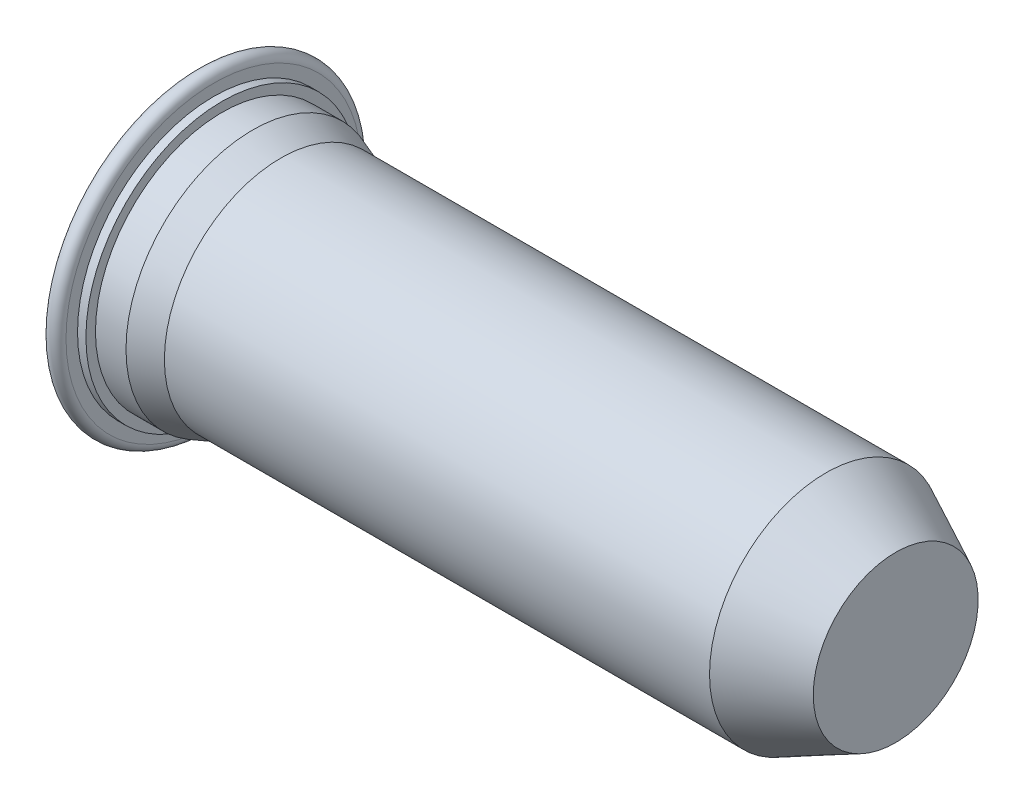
ISO-10303-21;
HEADER;
FILE_DESCRIPTION(('STEP AP214'),'2;1');
FILE_NAME('part.step','',(''),(''),'','','');
FILE_SCHEMA(('AUTOMOTIVE_DESIGN { 1 0 10303 214 1 1 1 1 }'));
ENDSEC;
DATA;
#1=APPLICATION_CONTEXT('core data for automotive mechanical design processes');
#2=APPLICATION_PROTOCOL_DEFINITION('international standard','automotive_design',2000,#1);
#3=PRODUCT_CONTEXT('',#1,'mechanical');
#4=PRODUCT('Part','Part','',(#3));
#5=PRODUCT_RELATED_PRODUCT_CATEGORY('part','',(#4));
#6=PRODUCT_DEFINITION_FORMATION('','',#4);
#7=PRODUCT_DEFINITION_CONTEXT('part definition',#1,'design');
#8=PRODUCT_DEFINITION('design','',#6,#7);
#9=PRODUCT_DEFINITION_SHAPE('','',#8);
#10=(LENGTH_UNIT() NAMED_UNIT(*) SI_UNIT(.MILLI.,.METRE.));
#11=(NAMED_UNIT(*) PLANE_ANGLE_UNIT() SI_UNIT($,.RADIAN.));
#12=(NAMED_UNIT(*) SI_UNIT($,.STERADIAN.) SOLID_ANGLE_UNIT());
#13=UNCERTAINTY_MEASURE_WITH_UNIT(LENGTH_MEASURE(1.E-05),#10,'distance_accuracy_value','');
#14=(GEOMETRIC_REPRESENTATION_CONTEXT(3) GLOBAL_UNCERTAINTY_ASSIGNED_CONTEXT((#13)) GLOBAL_UNIT_ASSIGNED_CONTEXT((#10,
#11,#12)) REPRESENTATION_CONTEXT('',''));
#15=CARTESIAN_POINT('',(0.,0.,0.));
#16=DIRECTION('',(0.,0.,1.));
#17=DIRECTION('',(1.,0.,0.));
#18=AXIS2_PLACEMENT_3D('',#15,#16,#17);
#19=CARTESIAN_POINT('',(0.,0.,0.));
#20=DIRECTION('',(-1.,0.,0.));
#21=DIRECTION('',(0.,0.,1.));
#22=AXIS2_PLACEMENT_3D('',#19,#20,#21);
#23=PLANE('',#22);
#24=CARTESIAN_POINT('',(0.,0.,0.));
#25=DIRECTION('',(-1.,0.,0.));
#26=DIRECTION('',(0.,0.,1.));
#27=AXIS2_PLACEMENT_3D('',#24,#25,#26);
#28=CIRCLE('',#27,4.02336);
#29=CARTESIAN_POINT('',(0.,0.,4.02336));
#30=VERTEX_POINT('',#29);
#31=EDGE_CURVE('E10',#30,#30,#28,.T.);
#32=ORIENTED_EDGE('',*,*,#31,.T.);
#33=EDGE_LOOP('',(#32));
#34=FACE_BOUND('',#33,.T.);
#35=ADVANCED_FACE('F30',(#34),#23,.T.);
#36=CARTESIAN_POINT('',(0.,0.,0.));
#37=DIRECTION('',(-1.,0.,0.));
#38=DIRECTION('',(0.,0.,1.));
#39=AXIS2_PLACEMENT_3D('',#36,#37,#38);
#40=CYLINDRICAL_SURFACE('',#39,4.02336);
#41=CARTESIAN_POINT('',(0.00508000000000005,0.,0.));
#42=DIRECTION('',(-1.,0.,0.));
#43=DIRECTION('',(0.,0.,1.));
#44=AXIS2_PLACEMENT_3D('',#41,#42,#43);
#45=CIRCLE('',#44,4.02336);
#46=CARTESIAN_POINT('',(0.00508000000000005,0.,4.02336));
#47=VERTEX_POINT('',#46);
#48=EDGE_CURVE('E36',#47,#47,#45,.T.);
#49=ORIENTED_EDGE('',*,*,#48,.T.);
#50=EDGE_LOOP('',(#49));
#51=FACE_BOUND('',#50,.T.);
#52=ORIENTED_EDGE('',*,*,#31,.F.);
#53=EDGE_LOOP('',(#52));
#54=FACE_BOUND('',#53,.T.);
#55=ADVANCED_FACE('F83',(#51,#54),#40,.T.);
#56=CARTESIAN_POINT('',(0.00508000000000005,4.02844,0.));
#57=DIRECTION('',(1.,0.,0.));
#58=DIRECTION('',(0.,0.,-1.));
#59=AXIS2_PLACEMENT_3D('',#56,#57,#58);
#60=PLANE('',#59);
#61=ORIENTED_EDGE('',*,*,#48,.F.);
#62=EDGE_LOOP('',(#61));
#63=FACE_BOUND('',#62,.T.);
#64=CARTESIAN_POINT('',(0.00508000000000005,0.,0.));
#65=DIRECTION('',(-1.,0.,0.));
#66=DIRECTION('',(0.,0.,1.));
#67=AXIS2_PLACEMENT_3D('',#64,#65,#66);
#68=CIRCLE('',#67,4.02844);
#69=CARTESIAN_POINT('',(0.00508000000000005,0.,4.02844));
#70=VERTEX_POINT('',#69);
#71=EDGE_CURVE('E40',#70,#70,#68,.T.);
#72=ORIENTED_EDGE('',*,*,#71,.T.);
#73=EDGE_LOOP('',(#72));
#74=FACE_BOUND('',#73,.T.);
#75=ADVANCED_FACE('F87',(#63,#74),#60,.F.);
#76=CARTESIAN_POINT('',(0.23114,0.,0.));
#77=DIRECTION('',(-1.,0.,0.));
#78=DIRECTION('',(0.,0.,1.));
#79=AXIS2_PLACEMENT_3D('',#76,#77,#78);
#80=TOROIDAL_SURFACE('',#79,4.02844,0.22606);
#81=CARTESIAN_POINT('',(0.4572,0.,0.));
#82=DIRECTION('',(-1.,0.,0.));
#83=DIRECTION('',(0.,0.,1.));
#84=AXIS2_PLACEMENT_3D('',#81,#82,#83);
#85=CIRCLE('',#84,4.02844);
#86=CARTESIAN_POINT('',(0.4572,0.,4.02844));
#87=VERTEX_POINT('',#86);
#88=EDGE_CURVE('E44',#87,#87,#85,.T.);
#89=ORIENTED_EDGE('',*,*,#88,.T.);
#90=EDGE_LOOP('',(#89));
#91=FACE_BOUND('',#90,.T.);
#92=ORIENTED_EDGE('',*,*,#71,.F.);
#93=EDGE_LOOP('',(#92));
#94=FACE_BOUND('',#93,.T.);
#95=ADVANCED_FACE('F91',(#91,#94),#80,.T.);
#96=CARTESIAN_POINT('',(0.4572,4.02844,0.));
#97=DIRECTION('',(1.,0.,0.));
#98=DIRECTION('',(0.,0.,-1.));
#99=AXIS2_PLACEMENT_3D('',#96,#97,#98);
#100=PLANE('',#99);
#101=CARTESIAN_POINT('',(0.4572,0.,0.));
#102=DIRECTION('',(-1.,0.,0.));
#103=DIRECTION('',(0.,0.,1.));
#104=AXIS2_PLACEMENT_3D('',#101,#102,#103);
#105=CIRCLE('',#104,3.71475);
#106=CARTESIAN_POINT('',(0.4572,0.,3.71475));
#107=VERTEX_POINT('',#106);
#108=EDGE_CURVE('E49',#107,#107,#105,.T.);
#109=ORIENTED_EDGE('',*,*,#108,.T.);
#110=EDGE_LOOP('',(#109));
#111=FACE_BOUND('',#110,.T.);
#112=ORIENTED_EDGE('',*,*,#88,.F.);
#113=EDGE_LOOP('',(#112));
#114=FACE_BOUND('',#113,.T.);
#115=ADVANCED_FACE('F98',(#111,#114),#100,.T.);
#116=CARTESIAN_POINT('',(0.,0.,0.));
#117=DIRECTION('',(-1.,0.,0.));
#118=DIRECTION('',(0.,0.,1.));
#119=AXIS2_PLACEMENT_3D('',#116,#117,#118);
#120=CYLINDRICAL_SURFACE('',#119,3.71475);
#121=CARTESIAN_POINT('',(0.6858,0.,0.));
#122=DIRECTION('',(-1.,0.,0.));
#123=DIRECTION('',(0.,0.,1.));
#124=AXIS2_PLACEMENT_3D('',#121,#122,#123);
#125=CIRCLE('',#124,3.71475);
#126=CARTESIAN_POINT('',(0.6858,0.,3.71475));
#127=VERTEX_POINT('',#126);
#128=EDGE_CURVE('E52',#127,#127,#125,.T.);
#129=ORIENTED_EDGE('',*,*,#128,.T.);
#130=EDGE_LOOP('',(#129));
#131=FACE_BOUND('',#130,.T.);
#132=ORIENTED_EDGE('',*,*,#108,.F.);
#133=EDGE_LOOP('',(#132));
#134=FACE_BOUND('',#133,.T.);
#135=ADVANCED_FACE('F102',(#131,#134),#120,.T.);
#136=CARTESIAN_POINT('',(0.6858,3.71475,0.));
#137=DIRECTION('',(1.,0.,0.));
#138=DIRECTION('',(0.,0.,-1.));
#139=AXIS2_PLACEMENT_3D('',#136,#137,#138);
#140=PLANE('',#139);
#141=CARTESIAN_POINT('',(0.6858,0.,0.));
#142=DIRECTION('',(-1.,0.,0.));
#143=DIRECTION('',(0.,0.,1.));
#144=AXIS2_PLACEMENT_3D('',#141,#142,#143);
#145=CIRCLE('',#144,3.4544);
#146=CARTESIAN_POINT('',(0.6858,0.,3.4544));
#147=VERTEX_POINT('',#146);
#148=EDGE_CURVE('E55',#147,#147,#145,.T.);
#149=ORIENTED_EDGE('',*,*,#148,.T.);
#150=EDGE_LOOP('',(#149));
#151=FACE_BOUND('',#150,.T.);
#152=ORIENTED_EDGE('',*,*,#128,.F.);
#153=EDGE_LOOP('',(#152));
#154=FACE_BOUND('',#153,.T.);
#155=ADVANCED_FACE('F106',(#151,#154),#140,.T.);
#156=CARTESIAN_POINT('',(0.,0.,0.));
#157=DIRECTION('',(-1.,0.,0.));
#158=DIRECTION('',(0.,0.,1.));
#159=AXIS2_PLACEMENT_3D('',#156,#157,#158);
#160=CYLINDRICAL_SURFACE('',#159,3.4544);
#161=ORIENTED_EDGE('',*,*,#148,.F.);
#162=EDGE_LOOP('',(#161));
#163=FACE_BOUND('',#162,.T.);
#164=CARTESIAN_POINT('',(1.51835480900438,0.,0.));
#165=DIRECTION('',(-1.,0.,0.));
#166=DIRECTION('',(0.,0.,1.));
#167=AXIS2_PLACEMENT_3D('',#164,#165,#166);
#168=CIRCLE('',#167,3.4544);
#169=CARTESIAN_POINT('',(1.51835480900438,0.,3.4544));
#170=VERTEX_POINT('',#169);
#171=EDGE_CURVE('E58',#170,#170,#168,.T.);
#172=ORIENTED_EDGE('',*,*,#171,.T.);
#173=EDGE_LOOP('',(#172));
#174=FACE_BOUND('',#173,.T.);
#175=ADVANCED_FACE('F110',(#163,#174),#160,.T.);
#176=CARTESIAN_POINT('',(2.286,0.,0.));
#177=DIRECTION('',(-1.,0.,0.));
#178=DIRECTION('',(0.,0.,1.));
#179=AXIS2_PLACEMENT_3D('',#176,#177,#178);
#180=CONICAL_SURFACE('',#179,3.175,0.349065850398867);
#181=ORIENTED_EDGE('',*,*,#171,.F.);
#182=EDGE_LOOP('',(#181));
#183=FACE_BOUND('',#182,.T.);
#184=CARTESIAN_POINT('',(2.286,0.,0.));
#185=DIRECTION('',(-1.,0.,0.));
#186=DIRECTION('',(0.,0.,1.));
#187=AXIS2_PLACEMENT_3D('',#184,#185,#186);
#188=CIRCLE('',#187,3.175);
#189=CARTESIAN_POINT('',(2.286,0.,3.175));
#190=VERTEX_POINT('',#189);
#191=EDGE_CURVE('E61',#190,#190,#188,.T.);
#192=ORIENTED_EDGE('',*,*,#191,.T.);
#193=EDGE_LOOP('',(#192));
#194=FACE_BOUND('',#193,.T.);
#195=ADVANCED_FACE('F114',(#183,#194),#180,.T.);
#196=CARTESIAN_POINT('',(0.,0.,0.));
#197=DIRECTION('',(-1.,0.,0.));
#198=DIRECTION('',(0.,0.,1.));
#199=AXIS2_PLACEMENT_3D('',#196,#197,#198);
#200=CYLINDRICAL_SURFACE('',#199,3.175);
#201=CARTESIAN_POINT('',(17.1491633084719,0.,0.));
#202=DIRECTION('',(-1.,0.,0.));
#203=DIRECTION('',(0.,0.,1.));
#204=AXIS2_PLACEMENT_3D('',#201,#202,#203);
#205=CIRCLE('',#204,3.175);
#206=CARTESIAN_POINT('',(17.1491633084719,0.,3.175));
#207=VERTEX_POINT('',#206);
#208=EDGE_CURVE('E64',#207,#207,#205,.T.);
#209=ORIENTED_EDGE('',*,*,#208,.T.);
#210=EDGE_LOOP('',(#209));
#211=FACE_BOUND('',#210,.T.);
#212=ORIENTED_EDGE('',*,*,#191,.F.);
#213=EDGE_LOOP('',(#212));
#214=FACE_BOUND('',#213,.T.);
#215=ADVANCED_FACE('F79',(#211,#214),#200,.T.);
#216=CARTESIAN_POINT('',(19.05,0.,0.));
#217=DIRECTION('',(-1.,0.,0.));
#218=DIRECTION('',(0.,0.,1.));
#219=AXIS2_PLACEMENT_3D('',#216,#217,#218);
#220=CONICAL_SURFACE('',#219,2.2479,0.45378560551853);
#221=ORIENTED_EDGE('',*,*,#208,.F.);
#222=EDGE_LOOP('',(#221));
#223=FACE_BOUND('',#222,.T.);
#224=CARTESIAN_POINT('',(19.05,0.,0.));
#225=DIRECTION('',(-1.,0.,0.));
#226=DIRECTION('',(0.,0.,1.));
#227=AXIS2_PLACEMENT_3D('',#224,#225,#226);
#228=CIRCLE('',#227,2.2479);
#229=CARTESIAN_POINT('',(19.05,0.,2.2479));
#230=VERTEX_POINT('',#229);
#231=EDGE_CURVE('E67',#230,#230,#228,.T.);
#232=ORIENTED_EDGE('',*,*,#231,.T.);
#233=EDGE_LOOP('',(#232));
#234=FACE_BOUND('',#233,.T.);
#235=ADVANCED_FACE('F71',(#223,#234),#220,.T.);
#236=CARTESIAN_POINT('',(19.05,2.2479,0.));
#237=DIRECTION('',(1.,0.,0.));
#238=DIRECTION('',(0.,0.,-1.));
#239=AXIS2_PLACEMENT_3D('',#236,#237,#238);
#240=PLANE('',#239);
#241=ORIENTED_EDGE('',*,*,#231,.F.);
#242=EDGE_LOOP('',(#241));
#243=FACE_BOUND('',#242,.T.);
#244=ADVANCED_FACE('F73',(#243),#240,.T.);
#245=CLOSED_SHELL('',(#35,#55,#75,#95,#115,#135,#155,#175,#195,#215,#235,#244));
#246=MANIFOLD_SOLID_BREP('B2',#245);
#247=ADVANCED_BREP_SHAPE_REPRESENTATION('',(#18,#246),#14);
#248=SHAPE_DEFINITION_REPRESENTATION(#9,#247);
ENDSEC;
END-ISO-10303-21;
